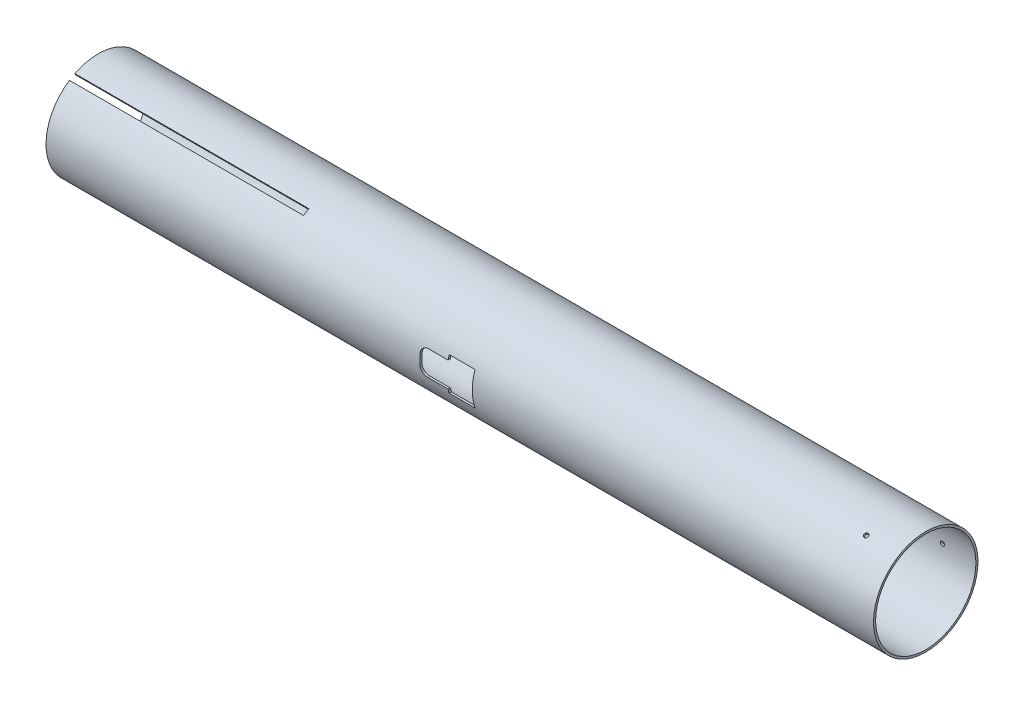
from build123d import *

# Parameters (mm, degrees)
SKETCH1_R          = 39.6875
SKETCH1_R_2        = 38.1
EXTRUDE1_DEPTH     = 628.65
SKETCH2_R          = 1.5875
HOLE1_DEPTH        = 632.15055083
SKETCH9_W          = 177.8
SKETCH9_H          = 4.7625
CUT_EXTRUDE5_DEPTH = 632.150550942
CIRPATTERN1_COUNT  = 3
CUT_EXTRUDE6_DEPTH = 632.150550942


with BuildPart() as part:
    # Sketch1 → Extrude1 (new body)
    with BuildSketch(Plane(origin=(0, 0, 0), x_dir=(0, 0, -1), z_dir=(1, 0, 0))):
        Circle(SKETCH1_R)
        Circle(SKETCH1_R_2, mode=Mode.SUBTRACT)
    extrude(amount=EXTRUDE1_DEPTH)

    # Sketch2 → hole1 (cut, through all)
    with BuildSketch(Plane.XY):
        with Locations((603.25, 0)):
            Circle(SKETCH2_R)
    hole1 = extrude(amount=-HOLE1_DEPTH, mode=Mode.SUBTRACT)

    # Sketch9 → Cut-Extrude5 (cut, through all)
    with BuildSketch(Plane.XY):
        with Locations((88.9, 0)):
            Rectangle(SKETCH9_W, SKETCH9_H)
    cut_extrude5 = extrude(amount=-CUT_EXTRUDE5_DEPTH, mode=Mode.SUBTRACT)

    # CirPattern1: hole1, Cut-Extrude5 ×3 about axis
    cirpattern1_axis = Axis((0, 0, 0), (1, 0, 0))
    add([hole1.rotate(cirpattern1_axis, i * 360 / CIRPATTERN1_COUNT) for i in range(1, CIRPATTERN1_COUNT)], mode=Mode.SUBTRACT)
    add([cut_extrude5.rotate(cirpattern1_axis, i * 360 / CIRPATTERN1_COUNT) for i in range(1, CIRPATTERN1_COUNT)], mode=Mode.SUBTRACT)

    # Sketch10 → Cut-Extrude6 (cut, through all)
    with BuildSketch(Plane.XY):
        with BuildLine():
            Line((304.292, 9.525), (304.292, 12.7))
            Line((304.292, 12.7), (323.85, 12.7))
            Line((323.85, 12.7), (323.85, -12.7))
            Line((323.85, -12.7), (304.292, -12.7))
            Line((304.292, -12.7), (304.292, -9.525))
            Line((304.292, -9.525), (289.052, -9.525))
            ThreePointArc((289.052, -9.525), (285.459897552, -8.037102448), (283.972, -4.445))
            Line((283.972, -4.445), (283.972, 4.445))
            ThreePointArc((283.972, 4.445), (285.459897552, 8.037102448), (289.052, 9.525))
            Line((289.052, 9.525), (304.292, 9.525))
        make_face()
    extrude(amount=CUT_EXTRUDE6_DEPTH, mode=Mode.SUBTRACT)


solid = part.part
